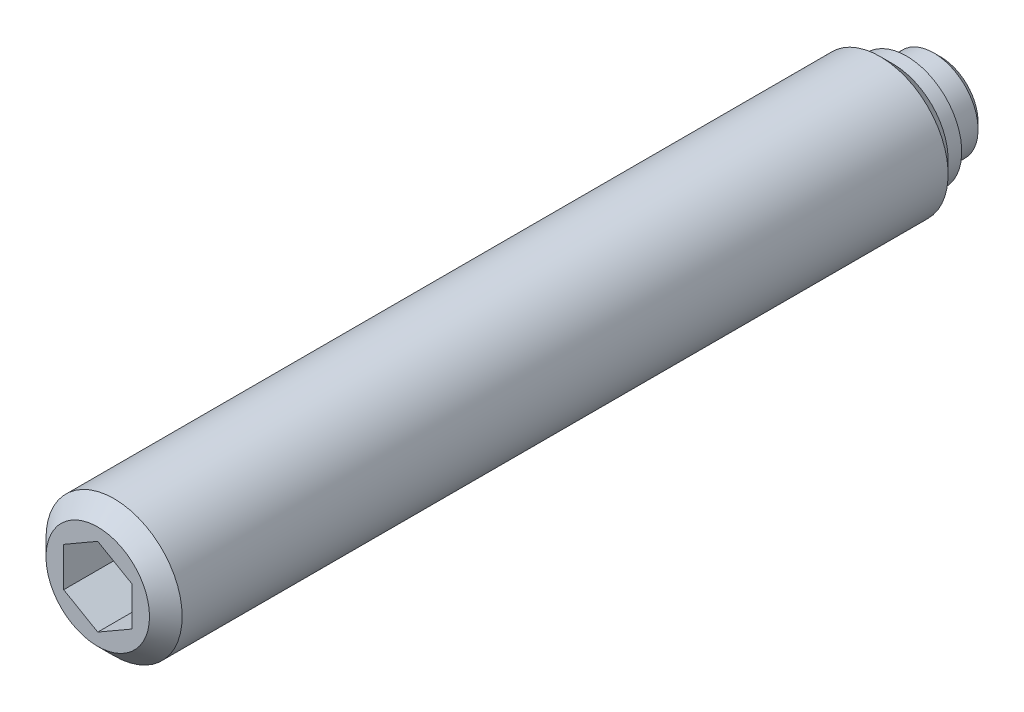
ISO-10303-21;
HEADER;
FILE_DESCRIPTION(('STEP AP214'),'2;1');
FILE_NAME('part.step','',(''),(''),'','','');
FILE_SCHEMA(('AUTOMOTIVE_DESIGN { 1 0 10303 214 1 1 1 1 }'));
ENDSEC;
DATA;
#1=APPLICATION_CONTEXT('core data for automotive mechanical design processes');
#2=APPLICATION_PROTOCOL_DEFINITION('international standard','automotive_design',2000,#1);
#3=PRODUCT_CONTEXT('',#1,'mechanical');
#4=PRODUCT('Part','Part','',(#3));
#5=PRODUCT_RELATED_PRODUCT_CATEGORY('part','',(#4));
#6=PRODUCT_DEFINITION_FORMATION('','',#4);
#7=PRODUCT_DEFINITION_CONTEXT('part definition',#1,'design');
#8=PRODUCT_DEFINITION('design','',#6,#7);
#9=PRODUCT_DEFINITION_SHAPE('','',#8);
#10=(LENGTH_UNIT() NAMED_UNIT(*) SI_UNIT(.MILLI.,.METRE.));
#11=(NAMED_UNIT(*) PLANE_ANGLE_UNIT() SI_UNIT($,.RADIAN.));
#12=(NAMED_UNIT(*) SI_UNIT($,.STERADIAN.) SOLID_ANGLE_UNIT());
#13=UNCERTAINTY_MEASURE_WITH_UNIT(LENGTH_MEASURE(1.E-05),#10,'distance_accuracy_value','');
#14=(GEOMETRIC_REPRESENTATION_CONTEXT(3) GLOBAL_UNCERTAINTY_ASSIGNED_CONTEXT((#13)) GLOBAL_UNIT_ASSIGNED_CONTEXT((#10,
#11,#12)) REPRESENTATION_CONTEXT('',''));
#15=CARTESIAN_POINT('',(0.,0.,0.));
#16=DIRECTION('',(0.,0.,1.));
#17=DIRECTION('',(1.,0.,0.));
#18=AXIS2_PLACEMENT_3D('',#15,#16,#17);
#19=CARTESIAN_POINT('',(0.,0.,0.));
#20=DIRECTION('',(0.,0.,-1.));
#21=DIRECTION('',(-1.,0.,0.));
#22=AXIS2_PLACEMENT_3D('',#19,#20,#21);
#23=CYLINDRICAL_SURFACE('',#22,3.25);
#24=CARTESIAN_POINT('',(0.,0.,0.5));
#25=DIRECTION('',(0.,0.,-1.));
#26=DIRECTION('',(-1.,0.,0.));
#27=AXIS2_PLACEMENT_3D('',#24,#25,#26);
#28=CIRCLE('',#27,3.25);
#29=CARTESIAN_POINT('',(-3.25,0.,0.5));
#30=VERTEX_POINT('',#29);
#31=EDGE_CURVE('E133',#30,#30,#28,.T.);
#32=ORIENTED_EDGE('',*,*,#31,.F.);
#33=EDGE_LOOP('',(#32));
#34=FACE_BOUND('',#33,.T.);
#35=CARTESIAN_POINT('',(0.,0.,2.5));
#36=DIRECTION('',(0.,0.,-1.));
#37=DIRECTION('',(-1.,0.,0.));
#38=AXIS2_PLACEMENT_3D('',#35,#36,#37);
#39=CIRCLE('',#38,3.25);
#40=CARTESIAN_POINT('',(-3.25,0.,2.5));
#41=VERTEX_POINT('',#40);
#42=EDGE_CURVE('E127',#41,#41,#39,.T.);
#43=ORIENTED_EDGE('',*,*,#42,.T.);
#44=EDGE_LOOP('',(#43));
#45=FACE_BOUND('',#44,.T.);
#46=ADVANCED_FACE('F14',(#34,#45),#23,.T.);
#47=CARTESIAN_POINT('',(0.,0.,0.5));
#48=DIRECTION('',(0.,0.,1.));
#49=DIRECTION('',(1.,0.,0.));
#50=AXIS2_PLACEMENT_3D('',#47,#48,#49);
#51=CONICAL_SURFACE('',#50,3.25,0.785398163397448);
#52=CARTESIAN_POINT('',(0.,0.,0.));
#53=DIRECTION('',(0.,0.,-1.));
#54=DIRECTION('',(-1.,0.,0.));
#55=AXIS2_PLACEMENT_3D('',#52,#53,#54);
#56=CIRCLE('',#55,2.75);
#57=CARTESIAN_POINT('',(-2.75,0.,0.));
#58=VERTEX_POINT('',#57);
#59=EDGE_CURVE('E130',#58,#58,#56,.T.);
#60=ORIENTED_EDGE('',*,*,#59,.F.);
#61=EDGE_LOOP('',(#60));
#62=FACE_BOUND('',#61,.T.);
#63=ORIENTED_EDGE('',*,*,#31,.T.);
#64=EDGE_LOOP('',(#63));
#65=FACE_BOUND('',#64,.T.);
#66=ADVANCED_FACE('F159',(#62,#65),#51,.T.);
#67=CARTESIAN_POINT('',(0.,2.75,0.));
#68=DIRECTION('',(0.,0.,1.));
#69=DIRECTION('',(1.,0.,0.));
#70=AXIS2_PLACEMENT_3D('',#67,#68,#69);
#71=PLANE('',#70);
#72=ORIENTED_EDGE('',*,*,#59,.T.);
#73=EDGE_LOOP('',(#72));
#74=FACE_BOUND('',#73,.T.);
#75=ADVANCED_FACE('F165',(#74),#71,.F.);
#76=CARTESIAN_POINT('',(0.,0.,2.5));
#77=DIRECTION('',(0.,0.,-1.));
#78=DIRECTION('',(-1.,0.,0.));
#79=AXIS2_PLACEMENT_3D('',#76,#77,#78);
#80=CYLINDRICAL_SURFACE('',#79,5.);
#81=CARTESIAN_POINT('',(0.,0.,4.45));
#82=DIRECTION('',(0.,0.,-1.));
#83=DIRECTION('',(-1.,0.,0.));
#84=AXIS2_PLACEMENT_3D('',#81,#82,#83);
#85=CIRCLE('',#84,5.);
#86=CARTESIAN_POINT('',(-5.,0.,4.45));
#87=VERTEX_POINT('',#86);
#88=EDGE_CURVE('E9',#87,#87,#85,.T.);
#89=ORIENTED_EDGE('',*,*,#88,.F.);
#90=EDGE_LOOP('',(#89));
#91=FACE_BOUND('',#90,.T.);
#92=CARTESIAN_POINT('',(0.,0.,60.7));
#93=DIRECTION('',(0.,0.,1.));
#94=DIRECTION('',(1.,0.,0.));
#95=AXIS2_PLACEMENT_3D('',#92,#93,#94);
#96=CIRCLE('',#95,5.);
#97=CARTESIAN_POINT('',(5.,0.,60.7));
#98=VERTEX_POINT('',#97);
#99=EDGE_CURVE('E124',#98,#98,#96,.T.);
#100=ORIENTED_EDGE('',*,*,#99,.F.);
#101=EDGE_LOOP('',(#100));
#102=FACE_BOUND('',#101,.T.);
#103=ADVANCED_FACE('F16',(#91,#102),#80,.T.);
#104=CARTESIAN_POINT('',(0.,4.05,2.5));
#105=DIRECTION('',(0.,0.,1.));
#106=DIRECTION('',(1.,0.,0.));
#107=AXIS2_PLACEMENT_3D('',#104,#105,#106);
#108=PLANE('',#107);
#109=CARTESIAN_POINT('',(0.,0.,2.5));
#110=DIRECTION('',(0.,0.,-1.));
#111=DIRECTION('',(-1.,0.,0.));
#112=AXIS2_PLACEMENT_3D('',#109,#110,#111);
#113=CIRCLE('',#112,4.05);
#114=CARTESIAN_POINT('',(-4.05,0.,2.5));
#115=VERTEX_POINT('',#114);
#116=EDGE_CURVE('E136',#115,#115,#113,.T.);
#117=ORIENTED_EDGE('',*,*,#116,.T.);
#118=EDGE_LOOP('',(#117));
#119=FACE_BOUND('',#118,.T.);
#120=ORIENTED_EDGE('',*,*,#42,.F.);
#121=EDGE_LOOP('',(#120));
#122=FACE_BOUND('',#121,.T.);
#123=ADVANCED_FACE('F156',(#119,#122),#108,.F.);
#124=CARTESIAN_POINT('',(0.,0.,2.5));
#125=DIRECTION('',(0.,0.,-1.));
#126=DIRECTION('',(-1.,0.,0.));
#127=AXIS2_PLACEMENT_3D('',#124,#125,#126);
#128=CYLINDRICAL_SURFACE('',#127,4.05);
#129=CARTESIAN_POINT('',(0.,0.,3.5));
#130=DIRECTION('',(0.,0.,-1.));
#131=DIRECTION('',(-1.,0.,0.));
#132=AXIS2_PLACEMENT_3D('',#129,#130,#131);
#133=CIRCLE('',#132,4.05);
#134=CARTESIAN_POINT('',(-4.05,0.,3.5));
#135=VERTEX_POINT('',#134);
#136=EDGE_CURVE('E22',#135,#135,#133,.T.);
#137=ORIENTED_EDGE('',*,*,#136,.T.);
#138=EDGE_LOOP('',(#137));
#139=FACE_BOUND('',#138,.T.);
#140=ORIENTED_EDGE('',*,*,#116,.F.);
#141=EDGE_LOOP('',(#140));
#142=FACE_BOUND('',#141,.T.);
#143=ADVANCED_FACE('F141',(#139,#142),#128,.T.);
#144=CARTESIAN_POINT('',(0.,0.,4.45));
#145=DIRECTION('',(0.,0.,1.));
#146=DIRECTION('',(1.,0.,0.));
#147=AXIS2_PLACEMENT_3D('',#144,#145,#146);
#148=CONICAL_SURFACE('',#147,5.,0.785398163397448);
#149=ORIENTED_EDGE('',*,*,#88,.T.);
#150=EDGE_LOOP('',(#149));
#151=FACE_BOUND('',#150,.T.);
#152=ORIENTED_EDGE('',*,*,#136,.F.);
#153=EDGE_LOOP('',(#152));
#154=FACE_BOUND('',#153,.T.);
#155=ADVANCED_FACE('F144',(#151,#154),#148,.T.);
#156=CARTESIAN_POINT('',(0.,-3.8,61.9));
#157=DIRECTION('',(0.,0.,1.));
#158=DIRECTION('',(1.,0.,0.));
#159=AXIS2_PLACEMENT_3D('',#156,#157,#158);
#160=PLANE('',#159);
#161=DIRECTION('',(0.866025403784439,-0.5,0.));
#162=VECTOR('',#161,1.);
#163=CARTESIAN_POINT('',(-2.5,-1.44337567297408,61.9));
#164=LINE('',#163,#162);
#165=CARTESIAN_POINT('',(-2.5,-1.44337567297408,61.9));
#166=VERTEX_POINT('',#165);
#167=CARTESIAN_POINT('',(0.,-2.88675134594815,61.9));
#168=VERTEX_POINT('',#167);
#169=EDGE_CURVE('E29',#166,#168,#164,.T.);
#170=ORIENTED_EDGE('',*,*,#169,.F.);
#171=DIRECTION('',(0.,-1.,0.));
#172=VECTOR('',#171,1.);
#173=CARTESIAN_POINT('',(-2.5,1.44337567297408,61.9));
#174=LINE('',#173,#172);
#175=CARTESIAN_POINT('',(-2.5,1.44337567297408,61.9));
#176=VERTEX_POINT('',#175);
#177=EDGE_CURVE('E112',#176,#166,#174,.T.);
#178=ORIENTED_EDGE('',*,*,#177,.F.);
#179=DIRECTION('',(-0.866025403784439,-0.5,0.));
#180=VECTOR('',#179,1.);
#181=CARTESIAN_POINT('',(0.,2.88675134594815,61.9));
#182=LINE('',#181,#180);
#183=CARTESIAN_POINT('',(0.,2.88675134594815,61.9));
#184=VERTEX_POINT('',#183);
#185=EDGE_CURVE('E110',#184,#176,#182,.T.);
#186=ORIENTED_EDGE('',*,*,#185,.F.);
#187=DIRECTION('',(-0.866025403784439,0.5,0.));
#188=VECTOR('',#187,1.);
#189=CARTESIAN_POINT('',(2.5,1.44337567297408,61.9));
#190=LINE('',#189,#188);
#191=CARTESIAN_POINT('',(2.5,1.44337567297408,61.9));
#192=VERTEX_POINT('',#191);
#193=EDGE_CURVE('E77',#192,#184,#190,.T.);
#194=ORIENTED_EDGE('',*,*,#193,.F.);
#195=DIRECTION('',(0.,1.,0.));
#196=VECTOR('',#195,1.);
#197=CARTESIAN_POINT('',(2.5,-1.44337567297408,61.9));
#198=LINE('',#197,#196);
#199=CARTESIAN_POINT('',(2.5,-1.44337567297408,61.9));
#200=VERTEX_POINT('',#199);
#201=EDGE_CURVE('E106',#200,#192,#198,.T.);
#202=ORIENTED_EDGE('',*,*,#201,.F.);
#203=DIRECTION('',(0.866025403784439,0.5,0.));
#204=VECTOR('',#203,1.);
#205=CARTESIAN_POINT('',(0.,-2.88675134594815,61.9));
#206=LINE('',#205,#204);
#207=EDGE_CURVE('E103',#168,#200,#206,.T.);
#208=ORIENTED_EDGE('',*,*,#207,.F.);
#209=EDGE_LOOP('',(#170,#178,#186,#194,#202,#208));
#210=FACE_BOUND('',#209,.T.);
#211=CARTESIAN_POINT('',(0.,0.,61.9));
#212=DIRECTION('',(0.,0.,1.));
#213=DIRECTION('',(1.,0.,0.));
#214=AXIS2_PLACEMENT_3D('',#211,#212,#213);
#215=CIRCLE('',#214,3.8);
#216=CARTESIAN_POINT('',(3.8,0.,61.9));
#217=VERTEX_POINT('',#216);
#218=EDGE_CURVE('E116',#217,#217,#215,.T.);
#219=ORIENTED_EDGE('',*,*,#218,.T.);
#220=EDGE_LOOP('',(#219));
#221=FACE_BOUND('',#220,.T.);
#222=ADVANCED_FACE('F146',(#210,#221),#160,.T.);
#223=CARTESIAN_POINT('',(0.,0.,61.9));
#224=DIRECTION('',(0.,0.,-1.));
#225=DIRECTION('',(-1.,0.,0.));
#226=AXIS2_PLACEMENT_3D('',#223,#224,#225);
#227=CONICAL_SURFACE('',#226,3.8,0.785398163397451);
#228=ORIENTED_EDGE('',*,*,#99,.T.);
#229=EDGE_LOOP('',(#228));
#230=FACE_BOUND('',#229,.T.);
#231=ORIENTED_EDGE('',*,*,#218,.F.);
#232=EDGE_LOOP('',(#231));
#233=FACE_BOUND('',#232,.T.);
#234=ADVANCED_FACE('F153',(#230,#233),#227,.T.);
#235=CARTESIAN_POINT('',(-2.5,-1.44337567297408,55.9));
#236=DIRECTION('',(-0.5,-0.866025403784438,0.));
#237=DIRECTION('',(0.866025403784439,-0.5,0.));
#238=AXIS2_PLACEMENT_3D('',#235,#236,#237);
#239=PLANE('',#238);
#240=ORIENTED_EDGE('',*,*,#169,.T.);
#241=DIRECTION('',(0.,0.,1.));
#242=VECTOR('',#241,1.);
#243=CARTESIAN_POINT('',(0.,-2.88675134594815,55.9));
#244=LINE('',#243,#242);
#245=CARTESIAN_POINT('',(0.,-2.88675134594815,55.9));
#246=VERTEX_POINT('',#245);
#247=EDGE_CURVE('E59',#246,#168,#244,.T.);
#248=ORIENTED_EDGE('',*,*,#247,.F.);
#249=DIRECTION('',(0.866025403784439,-0.5,0.));
#250=VECTOR('',#249,1.);
#251=CARTESIAN_POINT('',(-2.5,-1.44337567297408,55.9));
#252=LINE('',#251,#250);
#253=CARTESIAN_POINT('',(-2.5,-1.44337567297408,55.9));
#254=VERTEX_POINT('',#253);
#255=EDGE_CURVE('E114',#254,#246,#252,.T.);
#256=ORIENTED_EDGE('',*,*,#255,.F.);
#257=DIRECTION('',(0.,0.,1.));
#258=VECTOR('',#257,1.);
#259=CARTESIAN_POINT('',(-2.5,-1.44337567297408,55.9));
#260=LINE('',#259,#258);
#261=EDGE_CURVE('E37',#254,#166,#260,.T.);
#262=ORIENTED_EDGE('',*,*,#261,.T.);
#263=EDGE_LOOP('',(#240,#248,#256,#262));
#264=FACE_BOUND('',#263,.T.);
#265=ADVANCED_FACE('F191',(#264),#239,.F.);
#266=CARTESIAN_POINT('',(-2.5,1.44337567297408,55.9));
#267=DIRECTION('',(-1.,0.,0.));
#268=DIRECTION('',(0.,0.,1.));
#269=AXIS2_PLACEMENT_3D('',#266,#267,#268);
#270=PLANE('',#269);
#271=ORIENTED_EDGE('',*,*,#177,.T.);
#272=ORIENTED_EDGE('',*,*,#261,.F.);
#273=DIRECTION('',(0.,-1.,0.));
#274=VECTOR('',#273,1.);
#275=CARTESIAN_POINT('',(-2.5,1.44337567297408,55.9));
#276=LINE('',#275,#274);
#277=CARTESIAN_POINT('',(-2.5,1.44337567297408,55.9));
#278=VERTEX_POINT('',#277);
#279=EDGE_CURVE('E89',#278,#254,#276,.T.);
#280=ORIENTED_EDGE('',*,*,#279,.F.);
#281=DIRECTION('',(0.,0.,1.));
#282=VECTOR('',#281,1.);
#283=CARTESIAN_POINT('',(-2.5,1.44337567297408,55.9));
#284=LINE('',#283,#282);
#285=EDGE_CURVE('E81',#278,#176,#284,.T.);
#286=ORIENTED_EDGE('',*,*,#285,.T.);
#287=EDGE_LOOP('',(#271,#272,#280,#286));
#288=FACE_BOUND('',#287,.T.);
#289=ADVANCED_FACE('F198',(#288),#270,.F.);
#290=CARTESIAN_POINT('',(0.,2.88675134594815,55.9));
#291=DIRECTION('',(-0.5,0.866025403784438,0.));
#292=DIRECTION('',(-0.866025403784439,-0.5,0.));
#293=AXIS2_PLACEMENT_3D('',#290,#291,#292);
#294=PLANE('',#293);
#295=ORIENTED_EDGE('',*,*,#185,.T.);
#296=ORIENTED_EDGE('',*,*,#285,.F.);
#297=DIRECTION('',(-0.866025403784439,-0.5,0.));
#298=VECTOR('',#297,1.);
#299=CARTESIAN_POINT('',(0.,2.88675134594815,55.9));
#300=LINE('',#299,#298);
#301=CARTESIAN_POINT('',(0.,2.88675134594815,55.9));
#302=VERTEX_POINT('',#301);
#303=EDGE_CURVE('E85',#302,#278,#300,.T.);
#304=ORIENTED_EDGE('',*,*,#303,.F.);
#305=DIRECTION('',(0.,0.,1.));
#306=VECTOR('',#305,1.);
#307=CARTESIAN_POINT('',(0.,2.88675134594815,55.9));
#308=LINE('',#307,#306);
#309=EDGE_CURVE('E70',#302,#184,#308,.T.);
#310=ORIENTED_EDGE('',*,*,#309,.T.);
#311=EDGE_LOOP('',(#295,#296,#304,#310));
#312=FACE_BOUND('',#311,.T.);
#313=ADVANCED_FACE('F86',(#312),#294,.F.);
#314=CARTESIAN_POINT('',(2.5,1.44337567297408,55.9));
#315=DIRECTION('',(0.5,0.866025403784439,0.));
#316=DIRECTION('',(-0.866025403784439,0.5,0.));
#317=AXIS2_PLACEMENT_3D('',#314,#315,#316);
#318=PLANE('',#317);
#319=ORIENTED_EDGE('',*,*,#193,.T.);
#320=ORIENTED_EDGE('',*,*,#309,.F.);
#321=DIRECTION('',(-0.866025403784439,0.5,0.));
#322=VECTOR('',#321,1.);
#323=CARTESIAN_POINT('',(2.5,1.44337567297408,55.9));
#324=LINE('',#323,#322);
#325=CARTESIAN_POINT('',(2.5,1.44337567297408,55.9));
#326=VERTEX_POINT('',#325);
#327=EDGE_CURVE('E74',#326,#302,#324,.T.);
#328=ORIENTED_EDGE('',*,*,#327,.F.);
#329=DIRECTION('',(0.,0.,1.));
#330=VECTOR('',#329,1.);
#331=CARTESIAN_POINT('',(2.5,1.44337567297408,55.9));
#332=LINE('',#331,#330);
#333=EDGE_CURVE('E82',#326,#192,#332,.T.);
#334=ORIENTED_EDGE('',*,*,#333,.T.);
#335=EDGE_LOOP('',(#319,#320,#328,#334));
#336=FACE_BOUND('',#335,.T.);
#337=ADVANCED_FACE('F72',(#336),#318,.F.);
#338=CARTESIAN_POINT('',(2.5,-1.44337567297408,55.9));
#339=DIRECTION('',(1.,0.,0.));
#340=DIRECTION('',(0.,1.,0.));
#341=AXIS2_PLACEMENT_3D('',#338,#339,#340);
#342=PLANE('',#341);
#343=ORIENTED_EDGE('',*,*,#201,.T.);
#344=ORIENTED_EDGE('',*,*,#333,.F.);
#345=DIRECTION('',(0.,1.,0.));
#346=VECTOR('',#345,1.);
#347=CARTESIAN_POINT('',(2.5,-1.44337567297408,55.9));
#348=LINE('',#347,#346);
#349=CARTESIAN_POINT('',(2.5,-1.44337567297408,55.9));
#350=VERTEX_POINT('',#349);
#351=EDGE_CURVE('E95',#350,#326,#348,.T.);
#352=ORIENTED_EDGE('',*,*,#351,.F.);
#353=DIRECTION('',(0.,0.,1.));
#354=VECTOR('',#353,1.);
#355=CARTESIAN_POINT('',(2.5,-1.44337567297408,55.9));
#356=LINE('',#355,#354);
#357=EDGE_CURVE('E119',#350,#200,#356,.T.);
#358=ORIENTED_EDGE('',*,*,#357,.T.);
#359=EDGE_LOOP('',(#343,#344,#352,#358));
#360=FACE_BOUND('',#359,.T.);
#361=ADVANCED_FACE('F204',(#360),#342,.F.);
#362=CARTESIAN_POINT('',(0.,-2.88675134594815,55.9));
#363=DIRECTION('',(0.5,-0.866025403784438,0.));
#364=DIRECTION('',(0.866025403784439,0.5,0.));
#365=AXIS2_PLACEMENT_3D('',#362,#363,#364);
#366=PLANE('',#365);
#367=ORIENTED_EDGE('',*,*,#207,.T.);
#368=ORIENTED_EDGE('',*,*,#357,.F.);
#369=DIRECTION('',(0.866025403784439,0.5,0.));
#370=VECTOR('',#369,1.);
#371=CARTESIAN_POINT('',(0.,-2.88675134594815,55.9));
#372=LINE('',#371,#370);
#373=EDGE_CURVE('E97',#246,#350,#372,.T.);
#374=ORIENTED_EDGE('',*,*,#373,.F.);
#375=ORIENTED_EDGE('',*,*,#247,.T.);
#376=EDGE_LOOP('',(#367,#368,#374,#375));
#377=FACE_BOUND('',#376,.T.);
#378=ADVANCED_FACE('F201',(#377),#366,.F.);
#379=CARTESIAN_POINT('',(0.,0.,55.9));
#380=DIRECTION('',(0.,0.,1.));
#381=DIRECTION('',(1.,0.,0.));
#382=AXIS2_PLACEMENT_3D('',#379,#380,#381);
#383=PLANE('',#382);
#384=ORIENTED_EDGE('',*,*,#255,.T.);
#385=ORIENTED_EDGE('',*,*,#373,.T.);
#386=ORIENTED_EDGE('',*,*,#351,.T.);
#387=ORIENTED_EDGE('',*,*,#327,.T.);
#388=ORIENTED_EDGE('',*,*,#303,.T.);
#389=ORIENTED_EDGE('',*,*,#279,.T.);
#390=EDGE_LOOP('',(#384,#385,#386,#387,#388,#389));
#391=FACE_BOUND('',#390,.T.);
#392=ADVANCED_FACE('F92',(#391),#383,.T.);
#393=CLOSED_SHELL('',(#46,#66,#75,#103,#123,#143,#155,#222,#234,#265,#289,#313,#337,#361,#378,#392));
#394=MANIFOLD_SOLID_BREP('B1',#393);
#395=ADVANCED_BREP_SHAPE_REPRESENTATION('',(#18,#394),#14);
#396=SHAPE_DEFINITION_REPRESENTATION(#9,#395);
ENDSEC;
END-ISO-10303-21;
